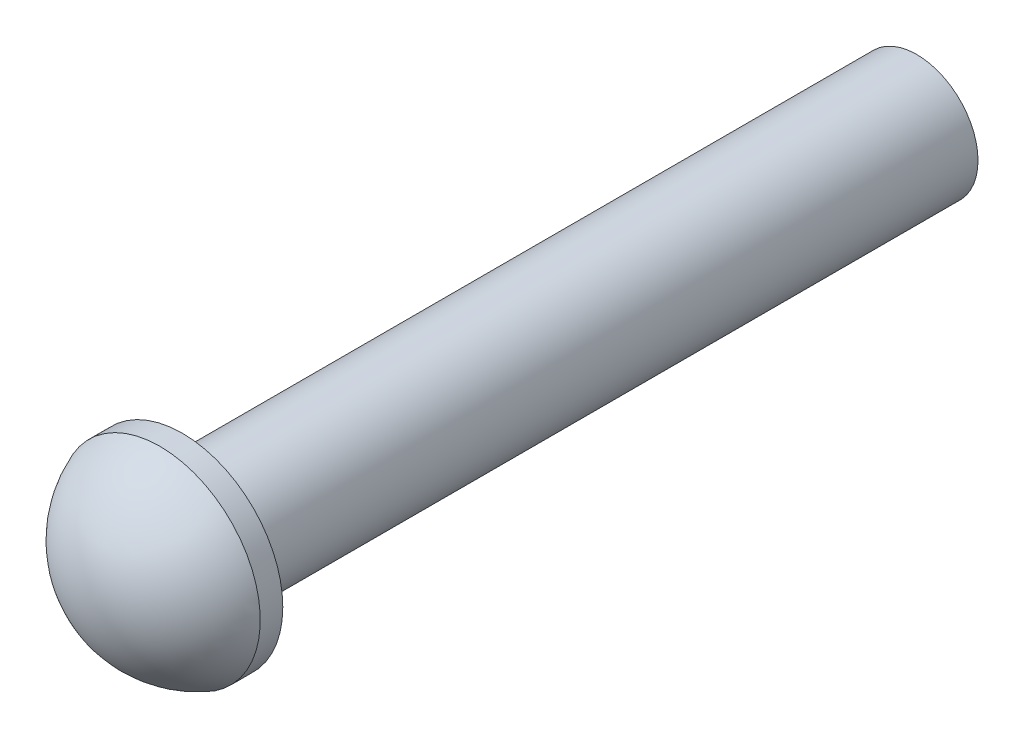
from build123d import *

# Parameters (mm, degrees)
SKETCH3_W = 3.418530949
SKETCH3_H = 1.284817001


with BuildPart() as part:
    # Sketch1 → Revolve1 (revolve)
    with BuildSketch(Plane(origin=(0, 0, 0), x_dir=(0, 0, -1), z_dir=(1, 0, 0)), mode=Mode.PRIVATE) as revolve1_sk:
        with BuildLine():
            Line((10.7188, 0), (10.7188, 1.5875))
            Line((10.7188, 1.5875), (-8.3312, 1.5875))
            Line((-8.3312, 1.5875), (-8.3312, 2.75329439))
            ThreePointArc((-8.3312, 2.75329439), (-10.038764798, 1.822173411), (-10.7188, 0))
            Line((-10.7188, 0), (10.7188, 0))
        make_face()
    revolve(revolve1_sk.sketch.rotate(Axis((0, 0, 13.3882591), (0, 0, -1)), 90), axis=Axis((0, 0, 13.3882591), (0, 0, -1)))

    # Sketch3 → Cut-Revolve2 (revolve, cut)
    with BuildSketch(Plane(origin=(0, 0, 0), x_dir=(0, 0, -1), z_dir=(1, 0, 0))):
        with Locations((-8.962973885, 3.245908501)):
            Rectangle(SKETCH3_W, SKETCH3_H)
    revolve(axis=Axis((0, 0, 0), (0, 0, 1)), mode=Mode.SUBTRACT)

    # Sketch2 → Cut-Revolve1 (revolve, cut)
    with BuildSketch(Plane(origin=(0, 0, 0), x_dir=(0, 0, -1), z_dir=(1, 0, 0))):
        Polygon((11.406207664, 1.5875), (13.172406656, 1.5875), (13.172406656, 0), (7.901053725, 0), (8.495413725, 0.59436), (9.686038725, 0.59436), align=None)
    revolve(axis=Axis((0, 0, 0), (0, 0, -1)), mode=Mode.SUBTRACT)


solid = part.part
